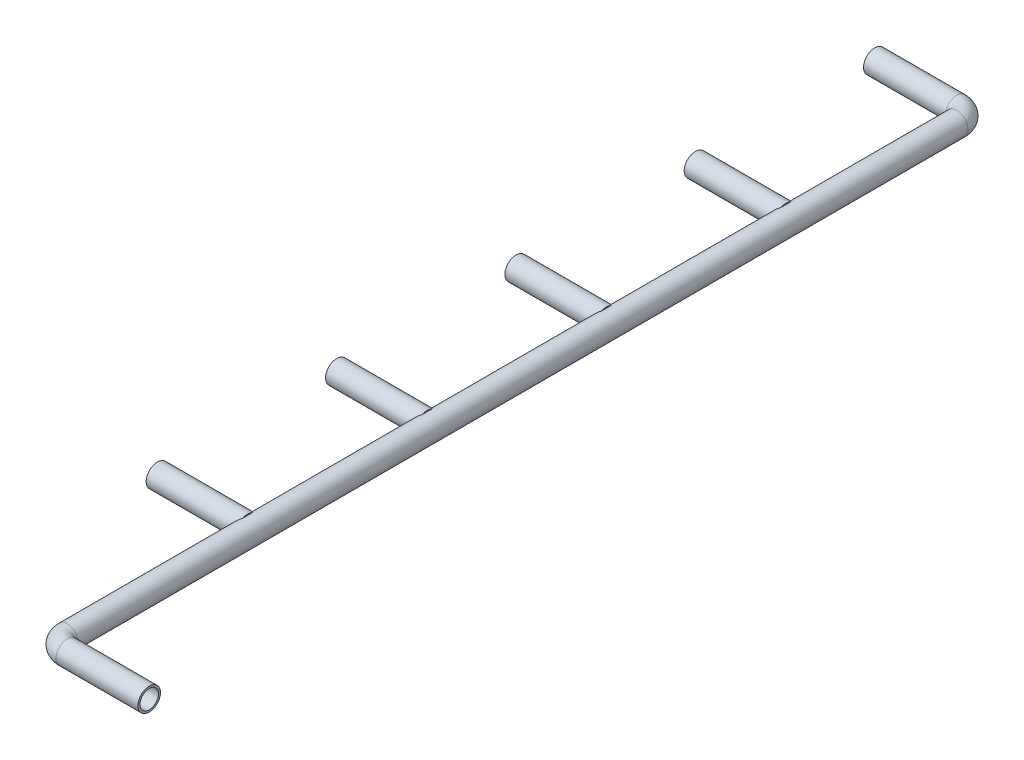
from build123d import *
from build123d.topology import SkipClean

# Parameters (mm, degrees)
SCHIZZO2_R                     = 5.5
SCHIZZO2_R_2                   = 4.5
ESTRUSIONE_ESTRUSIONE1_DEPTH   = 40
ESTRUSIONE_ESTRUSIONE1_2_DEPTH = 40
ESTRUSIONE_ESTRUSIONE1_3_DEPTH = 40
ESTRUSIONE_ESTRUSIONE1_4_DEPTH = 40
ESTRUSIONE_ESTRUSIONE1_5_DEPTH = 40
SCHIZZO3_R                     = 5.5
SCHIZZO3_R_2                   = 4.5
RIVOLUZIONE1_ANGLE             = 90
SCHIZZO4_R                     = 5.5
SCHIZZO4_R_2                   = 4.5
ESTRUSIONE_ESTRUSIONE2_DEPTH   = 434
SCHIZZO5_R                     = 5.5
SCHIZZO5_R_2                   = 4.5
ESTRUSIONE_ESTRUSIONE3_DEPTH   = 4
SCHIZZO6_R                     = 5.5
SCHIZZO6_R_2                   = 4.5
RIVOLUZIONE2_ANGLE             = 90
SCHIZZO7_R                     = 5.5
SCHIZZO7_R_2                   = 4.5
ESTRUSIONE_ESTRUSIONE4_DEPTH   = 40


with BuildPart() as part:
    # Schizzo2 → Estrusione-Estrusione1 (new body)
    with BuildSketch(Plane(origin=(0, 0, 0), x_dir=(0, 0, -1), z_dir=(1, 0, 0))):
        Circle(SCHIZZO2_R)
        Circle(SCHIZZO2_R_2, mode=Mode.SUBTRACT)
    extrude(amount=-ESTRUSIONE_ESTRUSIONE1_DEPTH)

    # Schizzo3 → Rivoluzione1 (revolve)
    with BuildSketch(Plane(origin=(0, 0, 0), x_dir=(0, 0, -1), z_dir=(1, 0, 0))):
        Circle(SCHIZZO3_R)
        Circle(SCHIZZO3_R_2, mode=Mode.SUBTRACT)
    revolve(axis=Axis((0, 6.054945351, 6.36003799), (0, -1, 0)), revolution_arc=RIVOLUZIONE1_ANGLE)

    # Schizzo4 → Estrusione-Estrusione2 (add)
    with BuildSketch(Plane.XY.offset(6.36003799)):
        with Locations((6.36003799, 0)):
            Circle(SCHIZZO4_R)
        with Locations((6.36003799, 0)):
            Circle(SCHIZZO4_R_2, mode=Mode.SUBTRACT)
    extrude(amount=ESTRUSIONE_ESTRUSIONE2_DEPTH)



with BuildPart() as body_2:
    # Schizzo2 → Estrusione-Estrusione1 2 (new body)
    with BuildSketch(Plane(origin=(0, 0, 0), x_dir=(0, 0, -1), z_dir=(1, 0, 0))):
        with Locations((-87.5, 0)):
            Circle(SCHIZZO2_R)
        with Locations((-87.5, 0)):
            Circle(SCHIZZO2_R_2, mode=Mode.SUBTRACT)
    extrude(amount=-ESTRUSIONE_ESTRUSIONE1_2_DEPTH)


with BuildPart() as body_3:
    # Schizzo2 → Estrusione-Estrusione1 3 (new body)
    with BuildSketch(Plane(origin=(0, 0, 0), x_dir=(0, 0, -1), z_dir=(1, 0, 0))):
        with Locations((-175, 0)):
            Circle(SCHIZZO2_R)
        with Locations((-175, 0)):
            Circle(SCHIZZO2_R_2, mode=Mode.SUBTRACT)
    extrude(amount=-ESTRUSIONE_ESTRUSIONE1_3_DEPTH)


with BuildPart() as body_4:
    # Schizzo2 → Estrusione-Estrusione1 4 (new body)
    with BuildSketch(Plane(origin=(0, 0, 0), x_dir=(0, 0, -1), z_dir=(1, 0, 0))):
        with Locations((-262.5, 0)):
            Circle(SCHIZZO2_R)
        with Locations((-262.5, 0)):
            Circle(SCHIZZO2_R_2, mode=Mode.SUBTRACT)
    extrude(amount=-ESTRUSIONE_ESTRUSIONE1_4_DEPTH)


with BuildPart() as body_5:
    # Schizzo2 → Estrusione-Estrusione1 5 (new body)
    with BuildSketch(Plane(origin=(0, 0, 0), x_dir=(0, 0, -1), z_dir=(1, 0, 0))):
        with Locations((-350, 0)):
            Circle(SCHIZZO2_R)
        with Locations((-350, 0)):
            Circle(SCHIZZO2_R_2, mode=Mode.SUBTRACT)
    extrude(amount=-ESTRUSIONE_ESTRUSIONE1_5_DEPTH)


with BuildPart() as part_1:
    with SkipClean():  # the faces are left unmerged after this step: merging them gives an invalid solid
        add(part.part)

        add(body_2.part)  # Estrusione-Estrusione3 merges body 2

        add(body_3.part)  # Estrusione-Estrusione3 merges body 3

        add(body_4.part)  # Estrusione-Estrusione3 merges body 4

        add(body_5.part)  # Estrusione-Estrusione3 merges body 5
        # Schizzo5 → Estrusione-Estrusione3 (add)
        # profile 1 of 4: a face of its own
        with BuildSketch(Plane(origin=(0, 0, 0), x_dir=(0, 0, -1), z_dir=(1, 0, 0))):
            with Locations((-87.5, 0)):
                Circle(SCHIZZO5_R)
            with Locations((-87.5, 0)):
                Circle(SCHIZZO5_R_2, mode=Mode.SUBTRACT)
        # profile 2 of 4: a face of its own
        with BuildSketch(Plane(origin=(0, 0, 0), x_dir=(0, 0, -1), z_dir=(1, 0, 0))):
            with Locations(Location((-175, 0, 0), (0, 0, 115.410318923))):
                Circle(SCHIZZO5_R)
            with Locations(Location((-175, 0, 0), (0, 0, 180))):
                Circle(SCHIZZO5_R_2, mode=Mode.SUBTRACT)
        # profile 3 of 4: a face of its own
        with BuildSketch(Plane(origin=(0, 0, 0), x_dir=(0, 0, -1), z_dir=(1, 0, 0))):
            with Locations(Location((-262.5, 0, 0), (0, 0, 115.410318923))):
                Circle(SCHIZZO5_R)
            with Locations(Location((-262.5, 0, 0), (0, 0, 180))):
                Circle(SCHIZZO5_R_2, mode=Mode.SUBTRACT)
        # profile 4 of 4: a face of its own
        with BuildSketch(Plane(origin=(0, 0, 0), x_dir=(0, 0, -1), z_dir=(1, 0, 0))):
            with Locations(Location((-350, 0, 0), (0, 0, 115.410318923))):
                Circle(SCHIZZO5_R)
            with Locations(Location((-350, 0, 0), (0, 0, 180))):
                Circle(SCHIZZO5_R_2, mode=Mode.SUBTRACT)
        extrude(amount=ESTRUSIONE_ESTRUSIONE3_DEPTH)

    # Schizzo6 → Rivoluzione2 (revolve)
    with SkipClean():  # the faces are left unmerged after this step: merging them gives an invalid solid
        with BuildSketch(Plane.XY.offset(440.36003799)):
            with Locations(Location((6.36003799, 0, 0), (0, 0, 180))):
                Circle(SCHIZZO6_R)
            with Locations(Location((6.36003799, 0, 0), (0, 0, 180))):
                Circle(SCHIZZO6_R_2, mode=Mode.SUBTRACT)
        revolve(axis=Axis((12.699402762, 5.5, 440.36003799), (0, 1, 0)), revolution_arc=RIVOLUZIONE2_ANGLE)

    # Schizzo7 → Estrusione-Estrusione4 (add)
    with SkipClean():  # the faces are left unmerged after this step: merging them gives an invalid solid
        with BuildSketch(Plane(origin=(12.699402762, 0, 0), x_dir=(0, 0, -1), z_dir=(1, 0, 0))):
            with Locations(Location((-446.699402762, 0, 0), (0, 0, 180))):
                Circle(SCHIZZO7_R)
            with Locations(Location((-446.699402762, 0, 0), (0, 0, 180))):
                Circle(SCHIZZO7_R_2, mode=Mode.SUBTRACT)
        extrude(amount=ESTRUSIONE_ESTRUSIONE4_DEPTH)


solid = part_1.part
